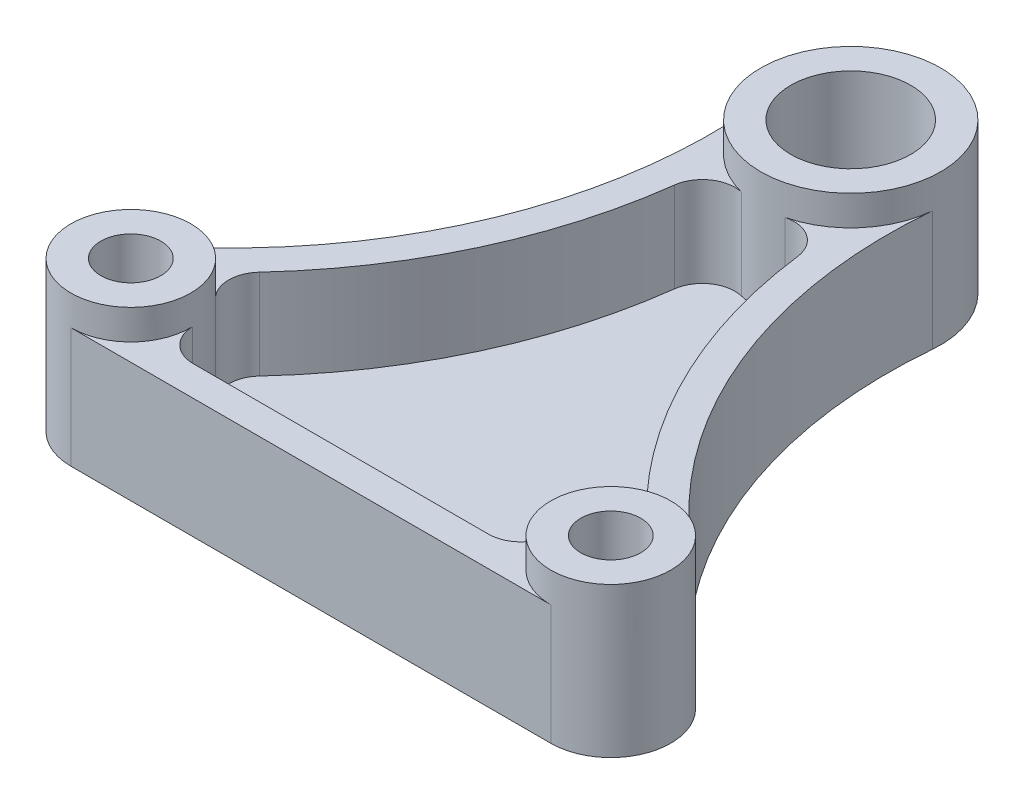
ISO-10303-21;
HEADER;
FILE_DESCRIPTION(('STEP AP214'),'2;1');
FILE_NAME('part.step','',(''),(''),'','','');
FILE_SCHEMA(('AUTOMOTIVE_DESIGN { 1 0 10303 214 1 1 1 1 }'));
ENDSEC;
DATA;
#1=APPLICATION_CONTEXT('core data for automotive mechanical design processes');
#2=APPLICATION_PROTOCOL_DEFINITION('international standard','automotive_design',2000,#1);
#3=PRODUCT_CONTEXT('',#1,'mechanical');
#4=PRODUCT('Part','Part','',(#3));
#5=PRODUCT_RELATED_PRODUCT_CATEGORY('part','',(#4));
#6=PRODUCT_DEFINITION_FORMATION('','',#4);
#7=PRODUCT_DEFINITION_CONTEXT('part definition',#1,'design');
#8=PRODUCT_DEFINITION('design','',#6,#7);
#9=PRODUCT_DEFINITION_SHAPE('','',#8);
#10=(LENGTH_UNIT() NAMED_UNIT(*) SI_UNIT(.MILLI.,.METRE.));
#11=(NAMED_UNIT(*) PLANE_ANGLE_UNIT() SI_UNIT($,.RADIAN.));
#12=(NAMED_UNIT(*) SI_UNIT($,.STERADIAN.) SOLID_ANGLE_UNIT());
#13=UNCERTAINTY_MEASURE_WITH_UNIT(LENGTH_MEASURE(1.E-05),#10,'distance_accuracy_value','');
#14=(GEOMETRIC_REPRESENTATION_CONTEXT(3) GLOBAL_UNCERTAINTY_ASSIGNED_CONTEXT((#13)) GLOBAL_UNIT_ASSIGNED_CONTEXT((#10,
#11,#12)) REPRESENTATION_CONTEXT('',''));
#15=CARTESIAN_POINT('',(0.,0.,0.));
#16=DIRECTION('',(0.,0.,1.));
#17=DIRECTION('',(1.,0.,0.));
#18=AXIS2_PLACEMENT_3D('',#15,#16,#17);
#19=CARTESIAN_POINT('',(-60.0847310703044,12.7,5.37872821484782));
#20=DIRECTION('',(0.,1.,0.));
#21=DIRECTION('',(0.,0.,1.));
#22=AXIS2_PLACEMENT_3D('',#19,#20,#21);
#23=PLANE('',#22);
#24=DIRECTION('',(1.,0.,0.));
#25=VECTOR('',#24,1.);
#26=CARTESIAN_POINT('',(-25.4,12.7,53.975));
#27=LINE('',#26,#25);
#28=CARTESIAN_POINT('',(-15.6242992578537,12.7,53.975));
#29=VERTEX_POINT('',#28);
#30=CARTESIAN_POINT('',(15.6242992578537,12.7,53.975));
#31=VERTEX_POINT('',#30);
#32=EDGE_CURVE('E276',#29,#31,#27,.T.);
#33=ORIENTED_EDGE('',*,*,#32,.F.);
#34=CARTESIAN_POINT('',(-15.6242992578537,12.7,50.546));
#35=DIRECTION('',(0.,1.,0.));
#36=DIRECTION('',(0.,0.,1.));
#37=AXIS2_PLACEMENT_3D('',#34,#35,#36);
#38=CIRCLE('',#37,3.429);
#39=CARTESIAN_POINT('',(-19.0521423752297,12.7,50.6350649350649));
#40=VERTEX_POINT('',#39);
#41=EDGE_CURVE('E261',#29,#40,#38,.F.);
#42=ORIENTED_EDGE('',*,*,#41,.T.);
#43=CARTESIAN_POINT('',(-25.4,12.7,50.8));
#44=DIRECTION('',(0.,1.,0.));
#45=DIRECTION('',(0.,0.,1.));
#46=AXIS2_PLACEMENT_3D('',#43,#44,#45);
#47=CIRCLE('',#46,6.35);
#48=CARTESIAN_POINT('',(-25.4,12.7,57.15));
#49=VERTEX_POINT('',#48);
#50=EDGE_CURVE('E308',#49,#40,#47,.T.);
#51=ORIENTED_EDGE('',*,*,#50,.F.);
#52=DIRECTION('',(1.,0.,0.));
#53=VECTOR('',#52,1.);
#54=CARTESIAN_POINT('',(-25.4,12.7,57.15));
#55=LINE('',#54,#53);
#56=CARTESIAN_POINT('',(25.4,12.7,57.15));
#57=VERTEX_POINT('',#56);
#58=EDGE_CURVE('E194',#49,#57,#55,.T.);
#59=ORIENTED_EDGE('',*,*,#58,.T.);
#60=CARTESIAN_POINT('',(25.4,12.7,50.8));
#61=DIRECTION('',(0.,1.,0.));
#62=DIRECTION('',(0.,0.,1.));
#63=AXIS2_PLACEMENT_3D('',#60,#61,#62);
#64=CIRCLE('',#63,6.35);
#65=CARTESIAN_POINT('',(19.0521423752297,12.7,50.6350649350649));
#66=VERTEX_POINT('',#65);
#67=EDGE_CURVE('E318',#57,#66,#64,.F.);
#68=ORIENTED_EDGE('',*,*,#67,.T.);
#69=CARTESIAN_POINT('',(15.6242992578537,12.7,50.546));
#70=DIRECTION('',(0.,1.,0.));
#71=DIRECTION('',(0.,0.,1.));
#72=AXIS2_PLACEMENT_3D('',#69,#70,#71);
#73=CIRCLE('',#72,3.429);
#74=EDGE_CURVE('E257',#66,#31,#73,.F.);
#75=ORIENTED_EDGE('',*,*,#74,.T.);
#76=EDGE_LOOP('',(#33,#42,#51,#59,#68,#75));
#77=FACE_BOUND('',#76,.T.);
#78=ADVANCED_FACE('F50',(#77),#23,.T.);
#79=CARTESIAN_POINT('',(60.0847310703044,12.7,5.37872821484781));
#80=DIRECTION('',(0.,1.,0.));
#81=DIRECTION('',(0.,0.,1.));
#82=AXIS2_PLACEMENT_3D('',#79,#80,#81);
#83=CIRCLE('',#82,53.975);
#84=CARTESIAN_POINT('',(20.509178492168,12.7,42.0812657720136));
#85=VERTEX_POINT('',#84);
#86=CARTESIAN_POINT('',(6.53487642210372,12.7,12.1399183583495));
#87=VERTEX_POINT('',#86);
#88=EDGE_CURVE('E266',#85,#87,#83,.F.);
#89=ORIENTED_EDGE('',*,*,#88,.F.);
#90=CARTESIAN_POINT('',(17.9949669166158,12.7,44.4129563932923));
#91=DIRECTION('',(0.,1.,0.));
#92=DIRECTION('',(0.,0.,1.));
#93=AXIS2_PLACEMENT_3D('',#90,#91,#92);
#94=CIRCLE('',#93,3.429);
#95=CARTESIAN_POINT('',(20.5915369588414,12.7,46.6525690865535));
#96=VERTEX_POINT('',#95);
#97=EDGE_CURVE('E264',#85,#96,#94,.F.);
#98=ORIENTED_EDGE('',*,*,#97,.T.);
#99=CARTESIAN_POINT('',(29.2538590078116,12.7,45.753192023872));
#100=VERTEX_POINT('',#99);
#101=EDGE_CURVE('E189',#96,#100,#64,.F.);
#102=ORIENTED_EDGE('',*,*,#101,.T.);
#103=CARTESIAN_POINT('',(60.0847310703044,12.7,5.37872821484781));
#104=DIRECTION('',(0.,-1.,0.));
#105=DIRECTION('',(0.,0.,1.));
#106=AXIS2_PLACEMENT_3D('',#103,#104,#105);
#107=CIRCLE('',#106,50.8);
#108=CARTESIAN_POINT('',(9.48706280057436,12.7,0.849272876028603));
#109=VERTEX_POINT('',#108);
#110=EDGE_CURVE('E185',#100,#109,#107,.T.);
#111=ORIENTED_EDGE('',*,*,#110,.T.);
#112=CARTESIAN_POINT('',(0.,12.7,0.));
#113=DIRECTION('',(0.,1.,0.));
#114=DIRECTION('',(0.,0.,1.));
#115=AXIS2_PLACEMENT_3D('',#112,#113,#114);
#116=CIRCLE('',#115,9.525);
#117=CARTESIAN_POINT('',(2.30359239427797,12.7,9.24224469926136));
#118=VERTEX_POINT('',#117);
#119=EDGE_CURVE('E65',#109,#118,#116,.F.);
#120=ORIENTED_EDGE('',*,*,#119,.T.);
#121=CARTESIAN_POINT('',(3.13288565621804,12.7,12.5694527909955));
#122=DIRECTION('',(0.,1.,0.));
#123=DIRECTION('',(0.,0.,1.));
#124=AXIS2_PLACEMENT_3D('',#121,#122,#123);
#125=CIRCLE('',#124,3.429);
#126=EDGE_CURVE('E58',#118,#87,#125,.F.);
#127=ORIENTED_EDGE('',*,*,#126,.T.);
#128=EDGE_LOOP('',(#89,#98,#102,#111,#120,#127));
#129=FACE_BOUND('',#128,.T.);
#130=ADVANCED_FACE('F187',(#129),#23,.T.);
#131=CARTESIAN_POINT('',(-60.0847310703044,12.7,5.37872821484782));
#132=DIRECTION('',(0.,1.,0.));
#133=DIRECTION('',(0.,0.,1.));
#134=AXIS2_PLACEMENT_3D('',#131,#132,#133);
#135=CIRCLE('',#134,53.975);
#136=CARTESIAN_POINT('',(-6.53487642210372,12.7,12.1399183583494));
#137=VERTEX_POINT('',#136);
#138=CARTESIAN_POINT('',(-20.509178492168,12.7,42.0812657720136));
#139=VERTEX_POINT('',#138);
#140=EDGE_CURVE('E372',#137,#139,#135,.F.);
#141=ORIENTED_EDGE('',*,*,#140,.F.);
#142=CARTESIAN_POINT('',(-3.13288565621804,12.7,12.5694527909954));
#143=DIRECTION('',(0.,1.,0.));
#144=DIRECTION('',(0.,0.,1.));
#145=AXIS2_PLACEMENT_3D('',#142,#143,#144);
#146=CIRCLE('',#145,3.429);
#147=CARTESIAN_POINT('',(-2.30359239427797,12.7,9.24224469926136));
#148=VERTEX_POINT('',#147);
#149=EDGE_CURVE('E12',#137,#148,#146,.F.);
#150=ORIENTED_EDGE('',*,*,#149,.T.);
#151=CARTESIAN_POINT('',(-9.48706280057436,12.7,0.849272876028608));
#152=VERTEX_POINT('',#151);
#153=EDGE_CURVE('E73',#148,#152,#116,.F.);
#154=ORIENTED_EDGE('',*,*,#153,.T.);
#155=CARTESIAN_POINT('',(-60.0847310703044,12.7,5.37872821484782));
#156=DIRECTION('',(0.,-1.,0.));
#157=DIRECTION('',(0.,0.,1.));
#158=AXIS2_PLACEMENT_3D('',#155,#156,#157);
#159=CIRCLE('',#158,50.8);
#160=CARTESIAN_POINT('',(-29.2538590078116,12.7,45.753192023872));
#161=VERTEX_POINT('',#160);
#162=EDGE_CURVE('E341',#152,#161,#159,.T.);
#163=ORIENTED_EDGE('',*,*,#162,.T.);
#164=CARTESIAN_POINT('',(-20.5915369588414,12.7,46.6525690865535));
#165=VERTEX_POINT('',#164);
#166=EDGE_CURVE('E313',#165,#161,#47,.T.);
#167=ORIENTED_EDGE('',*,*,#166,.F.);
#168=CARTESIAN_POINT('',(-17.9949669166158,12.7,44.4129563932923));
#169=DIRECTION('',(0.,1.,0.));
#170=DIRECTION('',(0.,0.,1.));
#171=AXIS2_PLACEMENT_3D('',#168,#169,#170);
#172=CIRCLE('',#171,3.429);
#173=EDGE_CURVE('E259',#165,#139,#172,.F.);
#174=ORIENTED_EDGE('',*,*,#173,.T.);
#175=EDGE_LOOP('',(#141,#150,#154,#163,#167,#174));
#176=FACE_BOUND('',#175,.T.);
#177=ADVANCED_FACE('F399',(#176),#23,.T.);
#178=CARTESIAN_POINT('',(-60.0847310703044,12.7,5.37872821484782));
#179=DIRECTION('',(0.,-1.,0.));
#180=DIRECTION('',(0.,0.,-1.));
#181=AXIS2_PLACEMENT_3D('',#178,#179,#180);
#182=CYLINDRICAL_SURFACE('',#181,50.8);
#183=CARTESIAN_POINT('',(-60.0847310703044,0.,5.37872821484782));
#184=DIRECTION('',(0.,-1.,0.));
#185=DIRECTION('',(0.,0.,1.));
#186=AXIS2_PLACEMENT_3D('',#183,#184,#185);
#187=CIRCLE('',#186,50.8);
#188=CARTESIAN_POINT('',(-9.48706280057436,0.,0.849272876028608));
#189=VERTEX_POINT('',#188);
#190=CARTESIAN_POINT('',(-29.2538590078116,0.,45.753192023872));
#191=VERTEX_POINT('',#190);
#192=EDGE_CURVE('E331',#189,#191,#187,.T.);
#193=ORIENTED_EDGE('',*,*,#192,.T.);
#194=DIRECTION('',(0.,-1.,0.));
#195=VECTOR('',#194,1.);
#196=CARTESIAN_POINT('',(-29.2538590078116,12.7,45.753192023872));
#197=LINE('',#196,#195);
#198=EDGE_CURVE('E212',#161,#191,#197,.T.);
#199=ORIENTED_EDGE('',*,*,#198,.F.);
#200=ORIENTED_EDGE('',*,*,#162,.F.);
#201=DIRECTION('',(0.,-1.,0.));
#202=VECTOR('',#201,1.);
#203=CARTESIAN_POINT('',(-9.48706280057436,12.7,0.849272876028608));
#204=LINE('',#203,#202);
#205=EDGE_CURVE('E193',#152,#189,#204,.T.);
#206=ORIENTED_EDGE('',*,*,#205,.T.);
#207=EDGE_LOOP('',(#193,#199,#200,#206));
#208=FACE_BOUND('',#207,.T.);
#209=ADVANCED_FACE('F403',(#208),#182,.F.);
#210=CARTESIAN_POINT('',(-25.4,12.7,50.8));
#211=DIRECTION('',(0.,-1.,0.));
#212=DIRECTION('',(0.,0.,-1.));
#213=AXIS2_PLACEMENT_3D('',#210,#211,#212);
#214=CYLINDRICAL_SURFACE('',#213,6.34999999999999);
#215=CARTESIAN_POINT('',(-25.4,3.175,50.8));
#216=DIRECTION('',(0.,1.,0.));
#217=DIRECTION('',(0.,0.,1.));
#218=AXIS2_PLACEMENT_3D('',#215,#216,#217);
#219=CIRCLE('',#218,6.35);
#220=CARTESIAN_POINT('',(-19.0521423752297,3.175,50.6350649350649));
#221=VERTEX_POINT('',#220);
#222=CARTESIAN_POINT('',(-20.5915369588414,3.175,46.6525690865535));
#223=VERTEX_POINT('',#222);
#224=EDGE_CURVE('E287',#221,#223,#219,.T.);
#225=ORIENTED_EDGE('',*,*,#224,.T.);
#226=DIRECTION('',(0.,-1.,0.));
#227=VECTOR('',#226,1.);
#228=CARTESIAN_POINT('',(-20.5915369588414,12.7,46.6525690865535));
#229=LINE('',#228,#227);
#230=EDGE_CURVE('E246',#223,#165,#229,.F.);
#231=ORIENTED_EDGE('',*,*,#230,.T.);
#232=ORIENTED_EDGE('',*,*,#166,.T.);
#233=ORIENTED_EDGE('',*,*,#198,.T.);
#234=CARTESIAN_POINT('',(-25.4,0.,50.8));
#235=DIRECTION('',(0.,1.,0.));
#236=DIRECTION('',(0.,0.,1.));
#237=AXIS2_PLACEMENT_3D('',#234,#235,#236);
#238=CIRCLE('',#237,6.34999999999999);
#239=CARTESIAN_POINT('',(-25.4,0.,57.15));
#240=VERTEX_POINT('',#239);
#241=EDGE_CURVE('E334',#191,#240,#238,.T.);
#242=ORIENTED_EDGE('',*,*,#241,.T.);
#243=DIRECTION('',(0.,-1.,0.));
#244=VECTOR('',#243,1.);
#245=CARTESIAN_POINT('',(-25.4,12.7,57.15));
#246=LINE('',#245,#244);
#247=EDGE_CURVE('E209',#49,#240,#246,.T.);
#248=ORIENTED_EDGE('',*,*,#247,.F.);
#249=ORIENTED_EDGE('',*,*,#50,.T.);
#250=DIRECTION('',(0.,-1.,0.));
#251=VECTOR('',#250,1.);
#252=CARTESIAN_POINT('',(-19.0521423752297,12.7,50.6350649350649));
#253=LINE('',#252,#251);
#254=EDGE_CURVE('E243',#40,#221,#253,.T.);
#255=ORIENTED_EDGE('',*,*,#254,.T.);
#256=EDGE_LOOP('',(#225,#231,#232,#233,#242,#248,#249,#255));
#257=FACE_BOUND('',#256,.T.);
#258=CARTESIAN_POINT('',(-25.4,15.875,50.8));
#259=DIRECTION('',(0.,-1.,0.));
#260=DIRECTION('',(0.,0.,-1.));
#261=AXIS2_PLACEMENT_3D('',#258,#259,#260);
#262=CIRCLE('',#261,6.35);
#263=CARTESIAN_POINT('',(-25.4,15.875,44.45));
#264=VERTEX_POINT('',#263);
#265=EDGE_CURVE('E182',#264,#264,#262,.T.);
#266=ORIENTED_EDGE('',*,*,#265,.T.);
#267=EDGE_LOOP('',(#266));
#268=FACE_BOUND('',#267,.T.);
#269=ADVANCED_FACE('F405',(#257,#268),#214,.T.);
#270=CARTESIAN_POINT('',(-25.4,12.7,57.15));
#271=DIRECTION('',(0.,0.,-1.));
#272=DIRECTION('',(-1.,0.,0.));
#273=AXIS2_PLACEMENT_3D('',#270,#271,#272);
#274=PLANE('',#273);
#275=DIRECTION('',(1.,0.,0.));
#276=VECTOR('',#275,1.);
#277=CARTESIAN_POINT('',(-25.4,0.,57.15));
#278=LINE('',#277,#276);
#279=CARTESIAN_POINT('',(25.4,0.,57.15));
#280=VERTEX_POINT('',#279);
#281=EDGE_CURVE('E336',#240,#280,#278,.T.);
#282=ORIENTED_EDGE('',*,*,#281,.T.);
#283=DIRECTION('',(0.,-1.,0.));
#284=VECTOR('',#283,1.);
#285=CARTESIAN_POINT('',(25.4,12.7,57.15));
#286=LINE('',#285,#284);
#287=EDGE_CURVE('E201',#57,#280,#286,.T.);
#288=ORIENTED_EDGE('',*,*,#287,.F.);
#289=ORIENTED_EDGE('',*,*,#58,.F.);
#290=ORIENTED_EDGE('',*,*,#247,.T.);
#291=EDGE_LOOP('',(#282,#288,#289,#290));
#292=FACE_BOUND('',#291,.T.);
#293=ADVANCED_FACE('F353',(#292),#274,.F.);
#294=CARTESIAN_POINT('',(25.4,12.7,50.8));
#295=DIRECTION('',(0.,-1.,0.));
#296=DIRECTION('',(0.,0.,-1.));
#297=AXIS2_PLACEMENT_3D('',#294,#295,#296);
#298=CYLINDRICAL_SURFACE('',#297,6.35);
#299=CARTESIAN_POINT('',(25.4,3.175,50.8));
#300=DIRECTION('',(0.,1.,0.));
#301=DIRECTION('',(0.,0.,1.));
#302=AXIS2_PLACEMENT_3D('',#299,#300,#301);
#303=CIRCLE('',#302,6.35);
#304=CARTESIAN_POINT('',(20.5915369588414,3.175,46.6525690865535));
#305=VERTEX_POINT('',#304);
#306=CARTESIAN_POINT('',(19.0521423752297,3.175,50.6350649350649));
#307=VERTEX_POINT('',#306);
#308=EDGE_CURVE('E293',#305,#307,#303,.T.);
#309=ORIENTED_EDGE('',*,*,#308,.T.);
#310=DIRECTION('',(0.,-1.,0.));
#311=VECTOR('',#310,1.);
#312=CARTESIAN_POINT('',(19.0521423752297,12.7,50.6350649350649));
#313=LINE('',#312,#311);
#314=EDGE_CURVE('E235',#307,#66,#313,.F.);
#315=ORIENTED_EDGE('',*,*,#314,.T.);
#316=ORIENTED_EDGE('',*,*,#67,.F.);
#317=ORIENTED_EDGE('',*,*,#287,.T.);
#318=CARTESIAN_POINT('',(25.4,0.,50.8));
#319=DIRECTION('',(0.,1.,0.));
#320=DIRECTION('',(0.,0.,1.));
#321=AXIS2_PLACEMENT_3D('',#318,#319,#320);
#322=CIRCLE('',#321,6.35);
#323=CARTESIAN_POINT('',(29.2538590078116,0.,45.753192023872));
#324=VERTEX_POINT('',#323);
#325=EDGE_CURVE('E338',#280,#324,#322,.T.);
#326=ORIENTED_EDGE('',*,*,#325,.T.);
#327=DIRECTION('',(0.,-1.,0.));
#328=VECTOR('',#327,1.);
#329=CARTESIAN_POINT('',(29.2538590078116,12.7,45.753192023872));
#330=LINE('',#329,#328);
#331=EDGE_CURVE('E199',#100,#324,#330,.T.);
#332=ORIENTED_EDGE('',*,*,#331,.F.);
#333=ORIENTED_EDGE('',*,*,#101,.F.);
#334=DIRECTION('',(0.,-1.,0.));
#335=VECTOR('',#334,1.);
#336=CARTESIAN_POINT('',(20.5915369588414,12.7,46.6525690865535));
#337=LINE('',#336,#335);
#338=EDGE_CURVE('E232',#96,#305,#337,.T.);
#339=ORIENTED_EDGE('',*,*,#338,.T.);
#340=EDGE_LOOP('',(#309,#315,#316,#317,#326,#332,#333,#339));
#341=FACE_BOUND('',#340,.T.);
#342=CARTESIAN_POINT('',(25.4,15.875,50.8));
#343=DIRECTION('',(0.,1.,0.));
#344=DIRECTION('',(0.,0.,1.));
#345=AXIS2_PLACEMENT_3D('',#342,#343,#344);
#346=CIRCLE('',#345,6.35);
#347=CARTESIAN_POINT('',(25.4,15.875,57.15));
#348=VERTEX_POINT('',#347);
#349=EDGE_CURVE('E312',#348,#348,#346,.T.);
#350=ORIENTED_EDGE('',*,*,#349,.F.);
#351=EDGE_LOOP('',(#350));
#352=FACE_BOUND('',#351,.T.);
#353=ADVANCED_FACE('F358',(#341,#352),#298,.T.);
#354=CARTESIAN_POINT('',(60.0847310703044,12.7,5.37872821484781));
#355=DIRECTION('',(0.,-1.,0.));
#356=DIRECTION('',(0.,0.,-1.));
#357=AXIS2_PLACEMENT_3D('',#354,#355,#356);
#358=CYLINDRICAL_SURFACE('',#357,50.8);
#359=CARTESIAN_POINT('',(60.0847310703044,0.,5.37872821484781));
#360=DIRECTION('',(0.,-1.,0.));
#361=DIRECTION('',(0.,0.,1.));
#362=AXIS2_PLACEMENT_3D('',#359,#360,#361);
#363=CIRCLE('',#362,50.8);
#364=CARTESIAN_POINT('',(9.48706280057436,0.,0.849272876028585));
#365=VERTEX_POINT('',#364);
#366=EDGE_CURVE('E198',#324,#365,#363,.T.);
#367=ORIENTED_EDGE('',*,*,#366,.T.);
#368=DIRECTION('',(0.,-1.,0.));
#369=VECTOR('',#368,1.);
#370=CARTESIAN_POINT('',(9.48706280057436,12.7,0.849272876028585));
#371=LINE('',#370,#369);
#372=EDGE_CURVE('E177',#109,#365,#371,.T.);
#373=ORIENTED_EDGE('',*,*,#372,.F.);
#374=ORIENTED_EDGE('',*,*,#110,.F.);
#375=ORIENTED_EDGE('',*,*,#331,.T.);
#376=EDGE_LOOP('',(#367,#373,#374,#375));
#377=FACE_BOUND('',#376,.T.);
#378=ADVANCED_FACE('F196',(#377),#358,.F.);
#379=CARTESIAN_POINT('',(0.,12.7,0.));
#380=DIRECTION('',(0.,-1.,0.));
#381=DIRECTION('',(0.,0.,-1.));
#382=AXIS2_PLACEMENT_3D('',#379,#380,#381);
#383=CYLINDRICAL_SURFACE('',#382,9.52499999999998);
#384=CARTESIAN_POINT('',(0.,3.175,0.));
#385=DIRECTION('',(0.,1.,0.));
#386=DIRECTION('',(0.,0.,1.));
#387=AXIS2_PLACEMENT_3D('',#384,#385,#386);
#388=CIRCLE('',#387,9.525);
#389=CARTESIAN_POINT('',(-2.30359239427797,3.175,9.24224469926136));
#390=VERTEX_POINT('',#389);
#391=CARTESIAN_POINT('',(2.30359239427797,3.175,9.24224469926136));
#392=VERTEX_POINT('',#391);
#393=EDGE_CURVE('E283',#390,#392,#388,.T.);
#394=ORIENTED_EDGE('',*,*,#393,.T.);
#395=DIRECTION('',(0.,-1.,0.));
#396=VECTOR('',#395,1.);
#397=CARTESIAN_POINT('',(2.30359239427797,12.7,9.24224469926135));
#398=LINE('',#397,#396);
#399=EDGE_CURVE('E180',#392,#118,#398,.F.);
#400=ORIENTED_EDGE('',*,*,#399,.T.);
#401=ORIENTED_EDGE('',*,*,#119,.F.);
#402=ORIENTED_EDGE('',*,*,#372,.T.);
#403=CARTESIAN_POINT('',(0.,0.,0.));
#404=DIRECTION('',(0.,1.,0.));
#405=DIRECTION('',(0.,0.,1.));
#406=AXIS2_PLACEMENT_3D('',#403,#404,#405);
#407=CIRCLE('',#406,9.52499999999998);
#408=EDGE_CURVE('E340',#365,#189,#407,.T.);
#409=ORIENTED_EDGE('',*,*,#408,.T.);
#410=ORIENTED_EDGE('',*,*,#205,.F.);
#411=ORIENTED_EDGE('',*,*,#153,.F.);
#412=DIRECTION('',(0.,-1.,0.));
#413=VECTOR('',#412,1.);
#414=CARTESIAN_POINT('',(-2.30359239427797,12.7,9.24224469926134));
#415=LINE('',#414,#413);
#416=EDGE_CURVE('E254',#148,#390,#415,.T.);
#417=ORIENTED_EDGE('',*,*,#416,.T.);
#418=EDGE_LOOP('',(#394,#400,#401,#402,#409,#410,#411,#417));
#419=FACE_BOUND('',#418,.T.);
#420=CARTESIAN_POINT('',(0.,15.875,0.));
#421=DIRECTION('',(0.,1.,0.));
#422=DIRECTION('',(0.,0.,1.));
#423=AXIS2_PLACEMENT_3D('',#420,#421,#422);
#424=CIRCLE('',#423,9.525);
#425=CARTESIAN_POINT('',(0.,15.875,9.525));
#426=VERTEX_POINT('',#425);
#427=EDGE_CURVE('E379',#426,#426,#424,.T.);
#428=ORIENTED_EDGE('',*,*,#427,.F.);
#429=EDGE_LOOP('',(#428));
#430=FACE_BOUND('',#429,.T.);
#431=ADVANCED_FACE('F174',(#419,#430),#383,.T.);
#432=CARTESIAN_POINT('',(-60.0847310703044,0.,5.37872821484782));
#433=DIRECTION('',(0.,1.,0.));
#434=DIRECTION('',(0.,0.,1.));
#435=AXIS2_PLACEMENT_3D('',#432,#433,#434);
#436=PLANE('',#435);
#437=CARTESIAN_POINT('',(0.,0.,0.));
#438=DIRECTION('',(0.,1.,0.));
#439=DIRECTION('',(0.,0.,1.));
#440=AXIS2_PLACEMENT_3D('',#437,#438,#439);
#441=CIRCLE('',#440,6.35);
#442=CARTESIAN_POINT('',(0.,0.,6.35));
#443=VERTEX_POINT('',#442);
#444=EDGE_CURVE('E380',#443,#443,#441,.T.);
#445=ORIENTED_EDGE('',*,*,#444,.T.);
#446=EDGE_LOOP('',(#445));
#447=FACE_BOUND('',#446,.T.);
#448=CARTESIAN_POINT('',(-25.4,0.,50.8));
#449=DIRECTION('',(0.,1.,0.));
#450=DIRECTION('',(0.,0.,1.));
#451=AXIS2_PLACEMENT_3D('',#448,#449,#450);
#452=CIRCLE('',#451,3.175);
#453=CARTESIAN_POINT('',(-25.4,0.,53.975));
#454=VERTEX_POINT('',#453);
#455=EDGE_CURVE('E384',#454,#454,#452,.T.);
#456=ORIENTED_EDGE('',*,*,#455,.T.);
#457=EDGE_LOOP('',(#456));
#458=FACE_BOUND('',#457,.T.);
#459=CARTESIAN_POINT('',(25.4,0.,50.8));
#460=DIRECTION('',(0.,1.,0.));
#461=DIRECTION('',(0.,0.,1.));
#462=AXIS2_PLACEMENT_3D('',#459,#460,#461);
#463=CIRCLE('',#462,3.175);
#464=CARTESIAN_POINT('',(25.4,0.,53.975));
#465=VERTEX_POINT('',#464);
#466=EDGE_CURVE('E390',#465,#465,#463,.T.);
#467=ORIENTED_EDGE('',*,*,#466,.T.);
#468=EDGE_LOOP('',(#467));
#469=FACE_BOUND('',#468,.T.);
#470=ORIENTED_EDGE('',*,*,#192,.F.);
#471=ORIENTED_EDGE('',*,*,#408,.F.);
#472=ORIENTED_EDGE('',*,*,#366,.F.);
#473=ORIENTED_EDGE('',*,*,#325,.F.);
#474=ORIENTED_EDGE('',*,*,#281,.F.);
#475=ORIENTED_EDGE('',*,*,#241,.F.);
#476=EDGE_LOOP('',(#470,#471,#472,#473,#474,#475));
#477=FACE_BOUND('',#476,.T.);
#478=ADVANCED_FACE('F425',(#447,#458,#469,#477),#436,.F.);
#479=CARTESIAN_POINT('',(25.4,15.875,50.8));
#480=DIRECTION('',(0.,1.,0.));
#481=DIRECTION('',(0.,0.,1.));
#482=AXIS2_PLACEMENT_3D('',#479,#480,#481);
#483=PLANE('',#482);
#484=CARTESIAN_POINT('',(25.4,15.875,50.8));
#485=DIRECTION('',(0.,1.,0.));
#486=DIRECTION('',(0.,0.,1.));
#487=AXIS2_PLACEMENT_3D('',#484,#485,#486);
#488=CIRCLE('',#487,3.175);
#489=CARTESIAN_POINT('',(25.4,15.875,53.975));
#490=VERTEX_POINT('',#489);
#491=EDGE_CURVE('E275',#490,#490,#488,.T.);
#492=ORIENTED_EDGE('',*,*,#491,.F.);
#493=EDGE_LOOP('',(#492));
#494=FACE_BOUND('',#493,.T.);
#495=ORIENTED_EDGE('',*,*,#349,.T.);
#496=EDGE_LOOP('',(#495));
#497=FACE_BOUND('',#496,.T.);
#498=ADVANCED_FACE('F415',(#494,#497),#483,.T.);
#499=CARTESIAN_POINT('',(-25.4,15.875,50.8));
#500=DIRECTION('',(0.,-1.,0.));
#501=DIRECTION('',(0.,0.,-1.));
#502=AXIS2_PLACEMENT_3D('',#499,#500,#501);
#503=PLANE('',#502);
#504=CARTESIAN_POINT('',(-25.4,15.875,50.8));
#505=DIRECTION('',(0.,1.,0.));
#506=DIRECTION('',(0.,0.,1.));
#507=AXIS2_PLACEMENT_3D('',#504,#505,#506);
#508=CIRCLE('',#507,3.175);
#509=CARTESIAN_POINT('',(-25.4,15.875,53.975));
#510=VERTEX_POINT('',#509);
#511=EDGE_CURVE('E386',#510,#510,#508,.T.);
#512=ORIENTED_EDGE('',*,*,#511,.F.);
#513=EDGE_LOOP('',(#512));
#514=FACE_BOUND('',#513,.T.);
#515=ORIENTED_EDGE('',*,*,#265,.F.);
#516=EDGE_LOOP('',(#515));
#517=FACE_BOUND('',#516,.T.);
#518=ADVANCED_FACE('F412',(#514,#517),#503,.F.);
#519=CARTESIAN_POINT('',(0.,15.875,0.));
#520=DIRECTION('',(0.,1.,0.));
#521=DIRECTION('',(0.,0.,1.));
#522=AXIS2_PLACEMENT_3D('',#519,#520,#521);
#523=PLANE('',#522);
#524=CARTESIAN_POINT('',(0.,15.875,0.));
#525=DIRECTION('',(0.,1.,0.));
#526=DIRECTION('',(0.,0.,1.));
#527=AXIS2_PLACEMENT_3D('',#524,#525,#526);
#528=CIRCLE('',#527,6.35);
#529=CARTESIAN_POINT('',(0.,15.875,6.35));
#530=VERTEX_POINT('',#529);
#531=EDGE_CURVE('E376',#530,#530,#528,.T.);
#532=ORIENTED_EDGE('',*,*,#531,.F.);
#533=EDGE_LOOP('',(#532));
#534=FACE_BOUND('',#533,.T.);
#535=ORIENTED_EDGE('',*,*,#427,.T.);
#536=EDGE_LOOP('',(#535));
#537=FACE_BOUND('',#536,.T.);
#538=ADVANCED_FACE('F414',(#534,#537),#523,.T.);
#539=CARTESIAN_POINT('',(0.,15.875,0.));
#540=DIRECTION('',(0.,-1.,0.));
#541=DIRECTION('',(0.,0.,-1.));
#542=AXIS2_PLACEMENT_3D('',#539,#540,#541);
#543=CYLINDRICAL_SURFACE('',#542,6.35);
#544=ORIENTED_EDGE('',*,*,#531,.T.);
#545=EDGE_LOOP('',(#544));
#546=FACE_BOUND('',#545,.T.);
#547=ORIENTED_EDGE('',*,*,#444,.F.);
#548=EDGE_LOOP('',(#547));
#549=FACE_BOUND('',#548,.T.);
#550=ADVANCED_FACE('F422',(#546,#549),#543,.F.);
#551=CARTESIAN_POINT('',(-25.4,15.875,50.8));
#552=DIRECTION('',(0.,-1.,0.));
#553=DIRECTION('',(0.,0.,-1.));
#554=AXIS2_PLACEMENT_3D('',#551,#552,#553);
#555=CYLINDRICAL_SURFACE('',#554,3.175);
#556=ORIENTED_EDGE('',*,*,#511,.T.);
#557=EDGE_LOOP('',(#556));
#558=FACE_BOUND('',#557,.T.);
#559=ORIENTED_EDGE('',*,*,#455,.F.);
#560=EDGE_LOOP('',(#559));
#561=FACE_BOUND('',#560,.T.);
#562=ADVANCED_FACE('F527',(#558,#561),#555,.F.);
#563=CARTESIAN_POINT('',(25.4,15.875,50.8));
#564=DIRECTION('',(0.,-1.,0.));
#565=DIRECTION('',(0.,0.,-1.));
#566=AXIS2_PLACEMENT_3D('',#563,#564,#565);
#567=CYLINDRICAL_SURFACE('',#566,3.175);
#568=ORIENTED_EDGE('',*,*,#491,.T.);
#569=EDGE_LOOP('',(#568));
#570=FACE_BOUND('',#569,.T.);
#571=ORIENTED_EDGE('',*,*,#466,.F.);
#572=EDGE_LOOP('',(#571));
#573=FACE_BOUND('',#572,.T.);
#574=ADVANCED_FACE('F537',(#570,#573),#567,.F.);
#575=CARTESIAN_POINT('',(-60.0847310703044,12.7,5.37872821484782));
#576=DIRECTION('',(0.,-1.,0.));
#577=DIRECTION('',(0.,0.,-1.));
#578=AXIS2_PLACEMENT_3D('',#575,#576,#577);
#579=CYLINDRICAL_SURFACE('',#578,53.975);
#580=ORIENTED_EDGE('',*,*,#140,.T.);
#581=DIRECTION('',(0.,-1.,0.));
#582=VECTOR('',#581,1.);
#583=CARTESIAN_POINT('',(-20.509178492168,12.7,42.0812657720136));
#584=LINE('',#583,#582);
#585=CARTESIAN_POINT('',(-20.509178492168,3.175,42.0812657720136));
#586=VERTEX_POINT('',#585);
#587=EDGE_CURVE('E240',#139,#586,#584,.T.);
#588=ORIENTED_EDGE('',*,*,#587,.T.);
#589=CARTESIAN_POINT('',(-60.0847310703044,3.175,5.37872821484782));
#590=DIRECTION('',(0.,1.,0.));
#591=DIRECTION('',(0.,0.,1.));
#592=AXIS2_PLACEMENT_3D('',#589,#590,#591);
#593=CIRCLE('',#592,53.975);
#594=CARTESIAN_POINT('',(-6.53487642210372,3.175,12.1399183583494));
#595=VERTEX_POINT('',#594);
#596=EDGE_CURVE('E286',#595,#586,#593,.F.);
#597=ORIENTED_EDGE('',*,*,#596,.F.);
#598=DIRECTION('',(0.,-1.,0.));
#599=VECTOR('',#598,1.);
#600=CARTESIAN_POINT('',(-6.53487642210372,12.7,12.1399183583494));
#601=LINE('',#600,#599);
#602=EDGE_CURVE('E238',#595,#137,#601,.F.);
#603=ORIENTED_EDGE('',*,*,#602,.T.);
#604=EDGE_LOOP('',(#580,#588,#597,#603));
#605=FACE_BOUND('',#604,.T.);
#606=ADVANCED_FACE('F471',(#605),#579,.T.);
#607=CARTESIAN_POINT('',(-25.4,12.7,53.975));
#608=DIRECTION('',(0.,0.,-1.));
#609=DIRECTION('',(-1.,0.,0.));
#610=AXIS2_PLACEMENT_3D('',#607,#608,#609);
#611=PLANE('',#610);
#612=ORIENTED_EDGE('',*,*,#32,.T.);
#613=DIRECTION('',(0.,-1.,0.));
#614=VECTOR('',#613,1.);
#615=CARTESIAN_POINT('',(15.6242992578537,12.7,53.975));
#616=LINE('',#615,#614);
#617=CARTESIAN_POINT('',(15.6242992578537,3.175,53.975));
#618=VERTEX_POINT('',#617);
#619=EDGE_CURVE('E217',#31,#618,#616,.T.);
#620=ORIENTED_EDGE('',*,*,#619,.T.);
#621=DIRECTION('',(1.,0.,0.));
#622=VECTOR('',#621,1.);
#623=CARTESIAN_POINT('',(-25.4,3.175,53.975));
#624=LINE('',#623,#622);
#625=CARTESIAN_POINT('',(-15.6242992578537,3.175,53.975));
#626=VERTEX_POINT('',#625);
#627=EDGE_CURVE('E290',#626,#618,#624,.T.);
#628=ORIENTED_EDGE('',*,*,#627,.F.);
#629=DIRECTION('',(0.,-1.,0.));
#630=VECTOR('',#629,1.);
#631=CARTESIAN_POINT('',(-15.6242992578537,12.7,53.975));
#632=LINE('',#631,#630);
#633=EDGE_CURVE('E215',#626,#29,#632,.F.);
#634=ORIENTED_EDGE('',*,*,#633,.T.);
#635=EDGE_LOOP('',(#612,#620,#628,#634));
#636=FACE_BOUND('',#635,.T.);
#637=ADVANCED_FACE('F369',(#636),#611,.T.);
#638=CARTESIAN_POINT('',(60.0847310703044,12.7,5.37872821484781));
#639=DIRECTION('',(0.,-1.,0.));
#640=DIRECTION('',(0.,0.,-1.));
#641=AXIS2_PLACEMENT_3D('',#638,#639,#640);
#642=CYLINDRICAL_SURFACE('',#641,53.975);
#643=CARTESIAN_POINT('',(60.0847310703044,3.175,5.37872821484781));
#644=DIRECTION('',(0.,1.,0.));
#645=DIRECTION('',(0.,0.,1.));
#646=AXIS2_PLACEMENT_3D('',#643,#644,#645);
#647=CIRCLE('',#646,53.975);
#648=CARTESIAN_POINT('',(20.509178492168,3.175,42.0812657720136));
#649=VERTEX_POINT('',#648);
#650=CARTESIAN_POINT('',(6.53487642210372,3.175,12.1399183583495));
#651=VERTEX_POINT('',#650);
#652=EDGE_CURVE('E284',#649,#651,#647,.F.);
#653=ORIENTED_EDGE('',*,*,#652,.F.);
#654=DIRECTION('',(0.,-1.,0.));
#655=VECTOR('',#654,1.);
#656=CARTESIAN_POINT('',(20.509178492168,12.7,42.0812657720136));
#657=LINE('',#656,#655);
#658=EDGE_CURVE('E252',#649,#85,#657,.F.);
#659=ORIENTED_EDGE('',*,*,#658,.T.);
#660=ORIENTED_EDGE('',*,*,#88,.T.);
#661=DIRECTION('',(0.,-1.,0.));
#662=VECTOR('',#661,1.);
#663=CARTESIAN_POINT('',(6.53487642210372,12.7,12.1399183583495));
#664=LINE('',#663,#662);
#665=EDGE_CURVE('E249',#87,#651,#664,.T.);
#666=ORIENTED_EDGE('',*,*,#665,.T.);
#667=EDGE_LOOP('',(#653,#659,#660,#666));
#668=FACE_BOUND('',#667,.T.);
#669=ADVANCED_FACE('F272',(#668),#642,.T.);
#670=CARTESIAN_POINT('',(-60.0847310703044,3.175,5.37872821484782));
#671=DIRECTION('',(0.,1.,0.));
#672=DIRECTION('',(0.,0.,1.));
#673=AXIS2_PLACEMENT_3D('',#670,#671,#672);
#674=PLANE('',#673);
#675=ORIENTED_EDGE('',*,*,#627,.T.);
#676=CARTESIAN_POINT('',(15.6242992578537,3.175,50.546));
#677=DIRECTION('',(0.,1.,0.));
#678=DIRECTION('',(0.,0.,1.));
#679=AXIS2_PLACEMENT_3D('',#676,#677,#678);
#680=CIRCLE('',#679,3.429);
#681=EDGE_CURVE('E230',#618,#307,#680,.T.);
#682=ORIENTED_EDGE('',*,*,#681,.T.);
#683=ORIENTED_EDGE('',*,*,#308,.F.);
#684=CARTESIAN_POINT('',(17.9949669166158,3.175,44.4129563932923));
#685=DIRECTION('',(0.,1.,0.));
#686=DIRECTION('',(0.,0.,1.));
#687=AXIS2_PLACEMENT_3D('',#684,#685,#686);
#688=CIRCLE('',#687,3.429);
#689=EDGE_CURVE('E224',#305,#649,#688,.T.);
#690=ORIENTED_EDGE('',*,*,#689,.T.);
#691=ORIENTED_EDGE('',*,*,#652,.T.);
#692=CARTESIAN_POINT('',(3.13288565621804,3.175,12.5694527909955));
#693=DIRECTION('',(0.,1.,0.));
#694=DIRECTION('',(0.,0.,1.));
#695=AXIS2_PLACEMENT_3D('',#692,#693,#694);
#696=CIRCLE('',#695,3.429);
#697=EDGE_CURVE('E222',#651,#392,#696,.T.);
#698=ORIENTED_EDGE('',*,*,#697,.T.);
#699=ORIENTED_EDGE('',*,*,#393,.F.);
#700=CARTESIAN_POINT('',(-3.13288565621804,3.175,12.5694527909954));
#701=DIRECTION('',(0.,1.,0.));
#702=DIRECTION('',(0.,0.,1.));
#703=AXIS2_PLACEMENT_3D('',#700,#701,#702);
#704=CIRCLE('',#703,3.429);
#705=EDGE_CURVE('E220',#390,#595,#704,.T.);
#706=ORIENTED_EDGE('',*,*,#705,.T.);
#707=ORIENTED_EDGE('',*,*,#596,.T.);
#708=CARTESIAN_POINT('',(-17.9949669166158,3.175,44.4129563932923));
#709=DIRECTION('',(0.,1.,0.));
#710=DIRECTION('',(0.,0.,1.));
#711=AXIS2_PLACEMENT_3D('',#708,#709,#710);
#712=CIRCLE('',#711,3.429);
#713=EDGE_CURVE('E228',#586,#223,#712,.T.);
#714=ORIENTED_EDGE('',*,*,#713,.T.);
#715=ORIENTED_EDGE('',*,*,#224,.F.);
#716=CARTESIAN_POINT('',(-15.6242992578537,3.175,50.546));
#717=DIRECTION('',(0.,1.,0.));
#718=DIRECTION('',(0.,0.,1.));
#719=AXIS2_PLACEMENT_3D('',#716,#717,#718);
#720=CIRCLE('',#719,3.429);
#721=EDGE_CURVE('E226',#221,#626,#720,.T.);
#722=ORIENTED_EDGE('',*,*,#721,.T.);
#723=EDGE_LOOP('',(#675,#682,#683,#690,#691,#698,#699,#706,#707,#714,#715,#722));
#724=FACE_BOUND('',#723,.T.);
#725=ADVANCED_FACE('F282',(#724),#674,.T.);
#726=CARTESIAN_POINT('',(15.6242992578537,12.7,50.546));
#727=DIRECTION('',(0.,-1.,0.));
#728=DIRECTION('',(0.,0.,-1.));
#729=AXIS2_PLACEMENT_3D('',#726,#727,#728);
#730=CYLINDRICAL_SURFACE('',#729,3.429);
#731=ORIENTED_EDGE('',*,*,#74,.F.);
#732=ORIENTED_EDGE('',*,*,#314,.F.);
#733=ORIENTED_EDGE('',*,*,#681,.F.);
#734=ORIENTED_EDGE('',*,*,#619,.F.);
#735=EDGE_LOOP('',(#731,#732,#733,#734));
#736=FACE_BOUND('',#735,.T.);
#737=ADVANCED_FACE('F365',(#736),#730,.F.);
#738=CARTESIAN_POINT('',(-17.9949669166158,12.7,44.4129563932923));
#739=DIRECTION('',(0.,1.,0.));
#740=DIRECTION('',(0.,0.,1.));
#741=AXIS2_PLACEMENT_3D('',#738,#739,#740);
#742=CYLINDRICAL_SURFACE('',#741,3.429);
#743=ORIENTED_EDGE('',*,*,#173,.F.);
#744=ORIENTED_EDGE('',*,*,#230,.F.);
#745=ORIENTED_EDGE('',*,*,#713,.F.);
#746=ORIENTED_EDGE('',*,*,#587,.F.);
#747=EDGE_LOOP('',(#743,#744,#745,#746));
#748=FACE_BOUND('',#747,.T.);
#749=ADVANCED_FACE('F450',(#748),#742,.F.);
#750=CARTESIAN_POINT('',(-15.6242992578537,12.7,50.546));
#751=DIRECTION('',(0.,-1.,0.));
#752=DIRECTION('',(0.,0.,-1.));
#753=AXIS2_PLACEMENT_3D('',#750,#751,#752);
#754=CYLINDRICAL_SURFACE('',#753,3.429);
#755=ORIENTED_EDGE('',*,*,#41,.F.);
#756=ORIENTED_EDGE('',*,*,#633,.F.);
#757=ORIENTED_EDGE('',*,*,#721,.F.);
#758=ORIENTED_EDGE('',*,*,#254,.F.);
#759=EDGE_LOOP('',(#755,#756,#757,#758));
#760=FACE_BOUND('',#759,.T.);
#761=ADVANCED_FACE('F453',(#760),#754,.F.);
#762=CARTESIAN_POINT('',(17.9949669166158,12.7,44.4129563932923));
#763=DIRECTION('',(0.,1.,0.));
#764=DIRECTION('',(0.,0.,1.));
#765=AXIS2_PLACEMENT_3D('',#762,#763,#764);
#766=CYLINDRICAL_SURFACE('',#765,3.429);
#767=ORIENTED_EDGE('',*,*,#97,.F.);
#768=ORIENTED_EDGE('',*,*,#658,.F.);
#769=ORIENTED_EDGE('',*,*,#689,.F.);
#770=ORIENTED_EDGE('',*,*,#338,.F.);
#771=EDGE_LOOP('',(#767,#768,#769,#770));
#772=FACE_BOUND('',#771,.T.);
#773=ADVANCED_FACE('F457',(#772),#766,.F.);
#774=CARTESIAN_POINT('',(3.13288565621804,12.7,12.5694527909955));
#775=DIRECTION('',(0.,1.,0.));
#776=DIRECTION('',(0.,0.,1.));
#777=AXIS2_PLACEMENT_3D('',#774,#775,#776);
#778=CYLINDRICAL_SURFACE('',#777,3.429);
#779=ORIENTED_EDGE('',*,*,#126,.F.);
#780=ORIENTED_EDGE('',*,*,#399,.F.);
#781=ORIENTED_EDGE('',*,*,#697,.F.);
#782=ORIENTED_EDGE('',*,*,#665,.F.);
#783=EDGE_LOOP('',(#779,#780,#781,#782));
#784=FACE_BOUND('',#783,.T.);
#785=ADVANCED_FACE('F278',(#784),#778,.F.);
#786=CARTESIAN_POINT('',(-3.13288565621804,12.7,12.5694527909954));
#787=DIRECTION('',(0.,1.,0.));
#788=DIRECTION('',(0.,0.,1.));
#789=AXIS2_PLACEMENT_3D('',#786,#787,#788);
#790=CYLINDRICAL_SURFACE('',#789,3.429);
#791=ORIENTED_EDGE('',*,*,#149,.F.);
#792=ORIENTED_EDGE('',*,*,#602,.F.);
#793=ORIENTED_EDGE('',*,*,#705,.F.);
#794=ORIENTED_EDGE('',*,*,#416,.F.);
#795=EDGE_LOOP('',(#791,#792,#793,#794));
#796=FACE_BOUND('',#795,.T.);
#797=ADVANCED_FACE('F52',(#796),#790,.F.);
#798=CLOSED_SHELL('',(#78,#130,#177,#209,#269,#293,#353,#378,#431,#478,#498,#518,#538,#550,#562,
#574,#606,#637,#669,#725,#737,#749,#761,#773,#785,#797));
#799=MANIFOLD_SOLID_BREP('B2',#798);
#800=ADVANCED_BREP_SHAPE_REPRESENTATION('',(#18,#799),#14);
#801=SHAPE_DEFINITION_REPRESENTATION(#9,#800);
ENDSEC;
END-ISO-10303-21;
